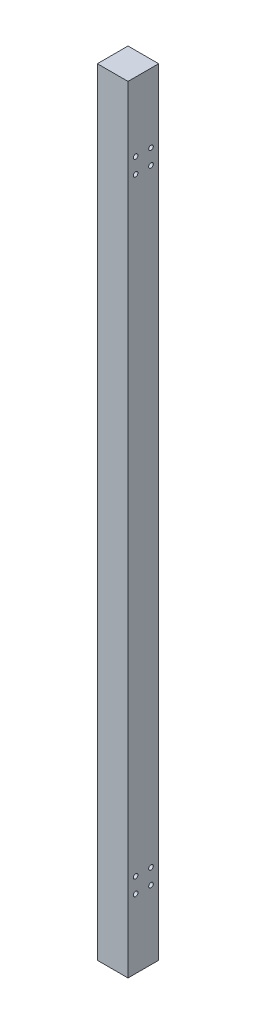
from build123d import *

# Parameters (mm, degrees)
SKETCH_1_W                   = 60
SKETCH_1_H                   = 60
EXTRUDE_1_DEPTH              = 1520
HOLE_WIZARD_M8_1_D           = 9
HOLE_WIZARD_M8_1_CBORE_D     = 18
HOLE_WIZARD_M8_1_CBORE_DEPTH = 0.5


with BuildPart() as part:
    # Sketch 1 → Extrude 1 (new body)
    with BuildSketch(Plane(origin=(0, 0, 0), x_dir=(1, 0, 0), z_dir=(0, 1, 0))):
        Rectangle(SKETCH_1_W, SKETCH_1_H)
    extrude(amount=EXTRUDE_1_DEPTH)

    # Hole Wizard M8 _1 (through all)
    with Locations(Plane.ZY.offset(30)):
        with Locations((-15, 135), (-15, 165), (15, 165), (15, 135), (-15, 1385), (15, 1385), (15, 1355), (-15, 1355)):
            CounterBoreHole(HOLE_WIZARD_M8_1_D / 2, HOLE_WIZARD_M8_1_CBORE_D / 2, HOLE_WIZARD_M8_1_CBORE_DEPTH)


solid = part.part
